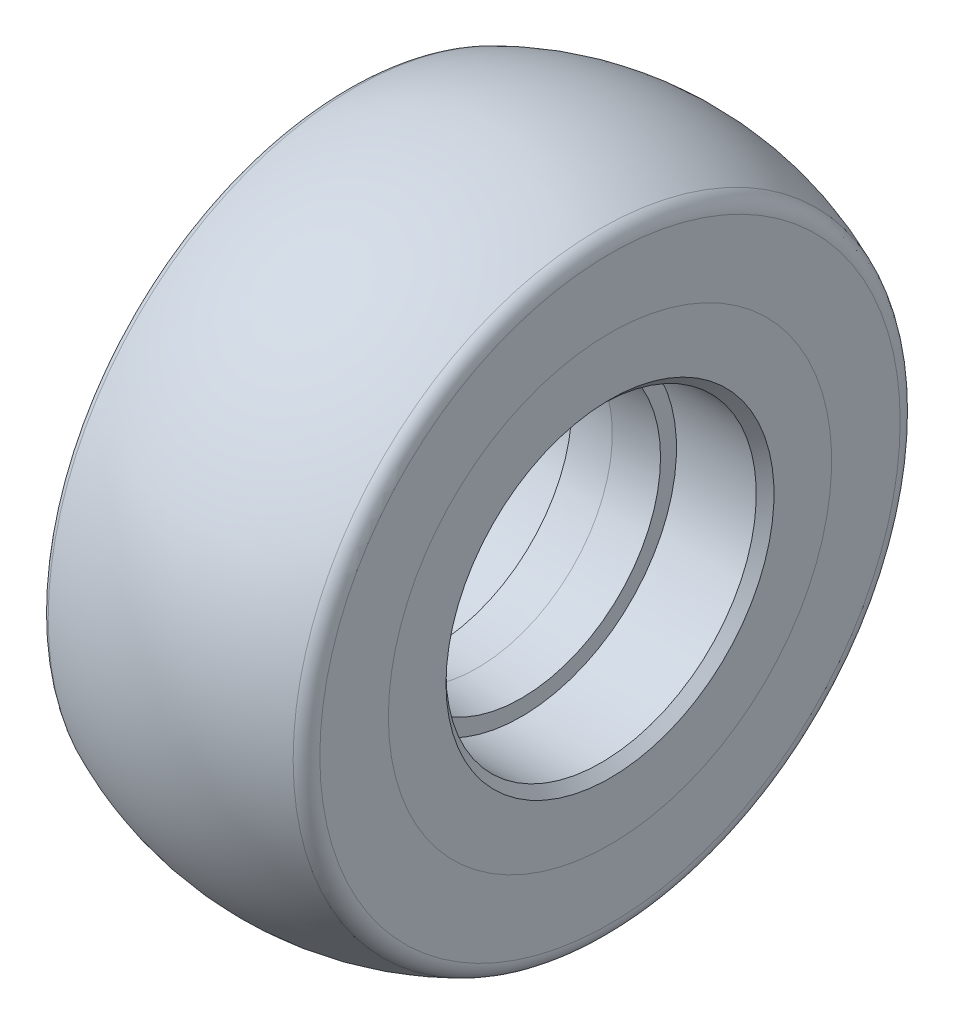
ISO-10303-21;
HEADER;
FILE_DESCRIPTION(('STEP AP214'),'2;1');
FILE_NAME('part.step','',(''),(''),'','','');
FILE_SCHEMA(('AUTOMOTIVE_DESIGN { 1 0 10303 214 1 1 1 1 }'));
ENDSEC;
DATA;
#1=APPLICATION_CONTEXT('core data for automotive mechanical design processes');
#2=APPLICATION_PROTOCOL_DEFINITION('international standard','automotive_design',2000,#1);
#3=PRODUCT_CONTEXT('',#1,'mechanical');
#4=PRODUCT('Part','Part','',(#3));
#5=PRODUCT_RELATED_PRODUCT_CATEGORY('part','',(#4));
#6=PRODUCT_DEFINITION_FORMATION('','',#4);
#7=PRODUCT_DEFINITION_CONTEXT('part definition',#1,'design');
#8=PRODUCT_DEFINITION('design','',#6,#7);
#9=PRODUCT_DEFINITION_SHAPE('','',#8);
#10=(LENGTH_UNIT() NAMED_UNIT(*) SI_UNIT(.MILLI.,.METRE.));
#11=(NAMED_UNIT(*) PLANE_ANGLE_UNIT() SI_UNIT($,.RADIAN.));
#12=(NAMED_UNIT(*) SI_UNIT($,.STERADIAN.) SOLID_ANGLE_UNIT());
#13=UNCERTAINTY_MEASURE_WITH_UNIT(LENGTH_MEASURE(1.E-05),#10,'distance_accuracy_value','');
#14=(GEOMETRIC_REPRESENTATION_CONTEXT(3) GLOBAL_UNCERTAINTY_ASSIGNED_CONTEXT((#13)) GLOBAL_UNIT_ASSIGNED_CONTEXT((#10,
#11,#12)) REPRESENTATION_CONTEXT('',''));
#15=CARTESIAN_POINT('',(0.,0.,0.));
#16=DIRECTION('',(0.,0.,1.));
#17=DIRECTION('',(1.,0.,0.));
#18=AXIS2_PLACEMENT_3D('',#15,#16,#17);
#19=CARTESIAN_POINT('',(-15.,0.,-32.7309114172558));
#20=DIRECTION('',(1.,0.,0.));
#21=DIRECTION('',(0.,0.,-1.));
#22=AXIS2_PLACEMENT_3D('',#19,#20,#21);
#23=PLANE('',#22);
#24=CARTESIAN_POINT('',(-15.,0.,0.));
#25=DIRECTION('',(-1.,0.,0.));
#26=DIRECTION('',(0.,0.,1.));
#27=AXIS2_PLACEMENT_3D('',#24,#25,#26);
#28=CIRCLE('',#27,25.);
#29=CARTESIAN_POINT('',(-15.,0.,25.));
#30=VERTEX_POINT('',#29);
#31=EDGE_CURVE('E11',#30,#30,#28,.T.);
#32=ORIENTED_EDGE('',*,*,#31,.F.);
#33=EDGE_LOOP('',(#32));
#34=FACE_BOUND('',#33,.T.);
#35=CARTESIAN_POINT('',(-15.,0.,0.));
#36=DIRECTION('',(-1.,0.,0.));
#37=DIRECTION('',(0.,0.,1.));
#38=AXIS2_PLACEMENT_3D('',#35,#36,#37);
#39=CIRCLE('',#38,32.7309114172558);
#40=CARTESIAN_POINT('',(-15.,0.,32.7309114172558));
#41=VERTEX_POINT('',#40);
#42=EDGE_CURVE('E94',#41,#41,#39,.T.);
#43=ORIENTED_EDGE('',*,*,#42,.T.);
#44=EDGE_LOOP('',(#43));
#45=FACE_BOUND('',#44,.T.);
#46=ADVANCED_FACE('F45',(#34,#45),#23,.F.);
#47=CARTESIAN_POINT('',(-15.,0.,0.));
#48=DIRECTION('',(1.,0.,0.));
#49=DIRECTION('',(0.,0.,-1.));
#50=AXIS2_PLACEMENT_3D('',#47,#48,#49);
#51=CONICAL_SURFACE('',#50,25.,0.099668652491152);
#52=CARTESIAN_POINT('',(-10.5493370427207,0.,0.));
#53=DIRECTION('',(-1.,0.,0.));
#54=DIRECTION('',(0.,0.,1.));
#55=AXIS2_PLACEMENT_3D('',#52,#53,#54);
#56=CIRCLE('',#55,25.4450662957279);
#57=CARTESIAN_POINT('',(-10.5493370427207,0.,25.4450662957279));
#58=VERTEX_POINT('',#57);
#59=EDGE_CURVE('E51',#58,#58,#56,.T.);
#60=ORIENTED_EDGE('',*,*,#59,.F.);
#61=EDGE_LOOP('',(#60));
#62=FACE_BOUND('',#61,.T.);
#63=ORIENTED_EDGE('',*,*,#31,.T.);
#64=EDGE_LOOP('',(#63));
#65=FACE_BOUND('',#64,.T.);
#66=ADVANCED_FACE('F173',(#62,#65),#51,.F.);
#67=CARTESIAN_POINT('',(-10.8478481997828,0.,0.));
#68=DIRECTION('',(-1.,0.,0.));
#69=DIRECTION('',(0.,0.,1.));
#70=AXIS2_PLACEMENT_3D('',#67,#68,#69);
#71=TOROIDAL_SURFACE('',#70,28.4301778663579,3.);
#72=CARTESIAN_POINT('',(-9.50620741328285,0.,0.));
#73=DIRECTION('',(-1.,0.,0.));
#74=DIRECTION('',(0.,0.,1.));
#75=AXIS2_PLACEMENT_3D('',#72,#73,#74);
#76=CIRCLE('',#75,25.7468962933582);
#77=CARTESIAN_POINT('',(-9.50620741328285,0.,25.7468962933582));
#78=VERTEX_POINT('',#77);
#79=EDGE_CURVE('E55',#78,#78,#76,.T.);
#80=ORIENTED_EDGE('',*,*,#79,.F.);
#81=EDGE_LOOP('',(#80));
#82=FACE_BOUND('',#81,.T.);
#83=ORIENTED_EDGE('',*,*,#59,.T.);
#84=EDGE_LOOP('',(#83));
#85=FACE_BOUND('',#84,.T.);
#86=ADVANCED_FACE('F168',(#82,#85),#71,.T.);
#87=CARTESIAN_POINT('',(-9.50620741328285,0.,0.));
#88=DIRECTION('',(1.,0.,0.));
#89=DIRECTION('',(0.,0.,-1.));
#90=AXIS2_PLACEMENT_3D('',#87,#88,#89);
#91=CONICAL_SURFACE('',#90,25.7468962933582,0.463647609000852);
#92=CARTESIAN_POINT('',(-7.5348122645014,0.,0.));
#93=DIRECTION('',(-1.,0.,0.));
#94=DIRECTION('',(0.,0.,1.));
#95=AXIS2_PLACEMENT_3D('',#92,#93,#94);
#96=CIRCLE('',#95,26.7325938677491);
#97=CARTESIAN_POINT('',(-7.5348122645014,0.,26.7325938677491));
#98=VERTEX_POINT('',#97);
#99=EDGE_CURVE('E59',#98,#98,#96,.T.);
#100=ORIENTED_EDGE('',*,*,#99,.F.);
#101=EDGE_LOOP('',(#100));
#102=FACE_BOUND('',#101,.T.);
#103=ORIENTED_EDGE('',*,*,#79,.T.);
#104=EDGE_LOOP('',(#103));
#105=FACE_BOUND('',#104,.T.);
#106=ADVANCED_FACE('F162',(#102,#105),#91,.F.);
#107=CARTESIAN_POINT('',(-6.19317147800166,0.,0.));
#108=DIRECTION('',(-1.,0.,0.));
#109=DIRECTION('',(0.,0.,1.));
#110=AXIS2_PLACEMENT_3D('',#107,#108,#109);
#111=TOROIDAL_SURFACE('',#110,24.0493122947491,3.00000000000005);
#112=CARTESIAN_POINT('',(-6.40722627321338,0.,0.));
#113=DIRECTION('',(-1.,0.,0.));
#114=DIRECTION('',(0.,0.,1.));
#115=AXIS2_PLACEMENT_3D('',#112,#113,#114);
#116=CIRCLE('',#115,27.0416659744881);
#117=CARTESIAN_POINT('',(-6.40722627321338,0.,27.0416659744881));
#118=VERTEX_POINT('',#117);
#119=EDGE_CURVE('E64',#118,#118,#116,.T.);
#120=ORIENTED_EDGE('',*,*,#119,.F.);
#121=EDGE_LOOP('',(#120));
#122=FACE_BOUND('',#121,.T.);
#123=ORIENTED_EDGE('',*,*,#99,.T.);
#124=EDGE_LOOP('',(#123));
#125=FACE_BOUND('',#124,.T.);
#126=ADVANCED_FACE('F156',(#122,#125),#111,.F.);
#127=CARTESIAN_POINT('',(-6.40722627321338,0.,0.));
#128=DIRECTION('',(1.,0.,0.));
#129=DIRECTION('',(0.,0.,-1.));
#130=AXIS2_PLACEMENT_3D('',#127,#128,#129);
#131=CONICAL_SURFACE('',#130,27.0416659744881,0.0714122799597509);
#132=CARTESIAN_POINT('',(0.,0.,0.));
#133=DIRECTION('',(-1.,0.,0.));
#134=DIRECTION('',(0.,0.,1.));
#135=AXIS2_PLACEMENT_3D('',#132,#133,#134);
#136=CIRCLE('',#135,27.4999999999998);
#137=CARTESIAN_POINT('',(0.,0.,27.4999999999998));
#138=VERTEX_POINT('',#137);
#139=EDGE_CURVE('E67',#138,#138,#136,.T.);
#140=ORIENTED_EDGE('',*,*,#139,.F.);
#141=EDGE_LOOP('',(#140));
#142=FACE_BOUND('',#141,.T.);
#143=ORIENTED_EDGE('',*,*,#119,.T.);
#144=EDGE_LOOP('',(#143));
#145=FACE_BOUND('',#144,.T.);
#146=ADVANCED_FACE('F150',(#142,#145),#131,.F.);
#147=CARTESIAN_POINT('',(0.,0.,0.));
#148=DIRECTION('',(-1.,0.,0.));
#149=DIRECTION('',(0.,0.,1.));
#150=AXIS2_PLACEMENT_3D('',#147,#148,#149);
#151=CONICAL_SURFACE('',#150,27.4999999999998,0.071412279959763);
#152=CARTESIAN_POINT('',(6.40722627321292,0.,0.));
#153=DIRECTION('',(-1.,0.,0.));
#154=DIRECTION('',(0.,0.,1.));
#155=AXIS2_PLACEMENT_3D('',#152,#153,#154);
#156=CIRCLE('',#155,27.041665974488);
#157=CARTESIAN_POINT('',(6.40722627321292,0.,27.041665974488));
#158=VERTEX_POINT('',#157);
#159=EDGE_CURVE('E70',#158,#158,#156,.T.);
#160=ORIENTED_EDGE('',*,*,#159,.F.);
#161=EDGE_LOOP('',(#160));
#162=FACE_BOUND('',#161,.T.);
#163=ORIENTED_EDGE('',*,*,#139,.T.);
#164=EDGE_LOOP('',(#163));
#165=FACE_BOUND('',#164,.T.);
#166=ADVANCED_FACE('F144',(#162,#165),#151,.F.);
#167=CARTESIAN_POINT('',(6.1931714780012,0.,0.));
#168=DIRECTION('',(-1.,0.,0.));
#169=DIRECTION('',(0.,0.,1.));
#170=AXIS2_PLACEMENT_3D('',#167,#168,#169);
#171=TOROIDAL_SURFACE('',#170,24.0493122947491,3.);
#172=CARTESIAN_POINT('',(7.53481226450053,0.,0.));
#173=DIRECTION('',(-1.,0.,0.));
#174=DIRECTION('',(0.,0.,1.));
#175=AXIS2_PLACEMENT_3D('',#172,#173,#174);
#176=CIRCLE('',#175,26.7325938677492);
#177=CARTESIAN_POINT('',(7.53481226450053,0.,26.7325938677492));
#178=VERTEX_POINT('',#177);
#179=EDGE_CURVE('E73',#178,#178,#176,.T.);
#180=ORIENTED_EDGE('',*,*,#179,.F.);
#181=EDGE_LOOP('',(#180));
#182=FACE_BOUND('',#181,.T.);
#183=ORIENTED_EDGE('',*,*,#159,.T.);
#184=EDGE_LOOP('',(#183));
#185=FACE_BOUND('',#184,.T.);
#186=ADVANCED_FACE('F138',(#182,#185),#171,.F.);
#187=CARTESIAN_POINT('',(7.53481226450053,0.,0.));
#188=DIRECTION('',(-1.,0.,0.));
#189=DIRECTION('',(0.,0.,1.));
#190=AXIS2_PLACEMENT_3D('',#187,#188,#189);
#191=CONICAL_SURFACE('',#190,26.7325938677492,0.463647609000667);
#192=CARTESIAN_POINT('',(9.50620741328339,0.,0.));
#193=DIRECTION('',(-1.,0.,0.));
#194=DIRECTION('',(0.,0.,1.));
#195=AXIS2_PLACEMENT_3D('',#192,#193,#194);
#196=CIRCLE('',#195,25.7468962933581);
#197=CARTESIAN_POINT('',(9.50620741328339,0.,25.7468962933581));
#198=VERTEX_POINT('',#197);
#199=EDGE_CURVE('E76',#198,#198,#196,.T.);
#200=ORIENTED_EDGE('',*,*,#199,.F.);
#201=EDGE_LOOP('',(#200));
#202=FACE_BOUND('',#201,.T.);
#203=ORIENTED_EDGE('',*,*,#179,.T.);
#204=EDGE_LOOP('',(#203));
#205=FACE_BOUND('',#204,.T.);
#206=ADVANCED_FACE('F132',(#202,#205),#191,.F.);
#207=CARTESIAN_POINT('',(10.8478481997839,0.,0.));
#208=DIRECTION('',(-1.,0.,0.));
#209=DIRECTION('',(0.,0.,1.));
#210=AXIS2_PLACEMENT_3D('',#207,#208,#209);
#211=TOROIDAL_SURFACE('',#210,28.4301778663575,2.99999999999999);
#212=CARTESIAN_POINT('',(10.5493370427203,0.,0.));
#213=DIRECTION('',(-1.,0.,0.));
#214=DIRECTION('',(0.,0.,1.));
#215=AXIS2_PLACEMENT_3D('',#212,#213,#214);
#216=CIRCLE('',#215,25.4450662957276);
#217=CARTESIAN_POINT('',(10.5493370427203,0.,25.4450662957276));
#218=VERTEX_POINT('',#217);
#219=EDGE_CURVE('E79',#218,#218,#216,.T.);
#220=ORIENTED_EDGE('',*,*,#219,.F.);
#221=EDGE_LOOP('',(#220));
#222=FACE_BOUND('',#221,.T.);
#223=ORIENTED_EDGE('',*,*,#199,.T.);
#224=EDGE_LOOP('',(#223));
#225=FACE_BOUND('',#224,.T.);
#226=ADVANCED_FACE('F126',(#222,#225),#211,.T.);
#227=CARTESIAN_POINT('',(10.5493370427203,0.,0.));
#228=DIRECTION('',(-1.,0.,0.));
#229=DIRECTION('',(0.,0.,1.));
#230=AXIS2_PLACEMENT_3D('',#227,#228,#229);
#231=CONICAL_SURFACE('',#230,25.4450662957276,0.0996686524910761);
#232=CARTESIAN_POINT('',(15.,0.,0.));
#233=DIRECTION('',(-1.,0.,0.));
#234=DIRECTION('',(0.,0.,1.));
#235=AXIS2_PLACEMENT_3D('',#232,#233,#234);
#236=CIRCLE('',#235,25.);
#237=CARTESIAN_POINT('',(15.,0.,25.));
#238=VERTEX_POINT('',#237);
#239=EDGE_CURVE('E82',#238,#238,#236,.T.);
#240=ORIENTED_EDGE('',*,*,#239,.F.);
#241=EDGE_LOOP('',(#240));
#242=FACE_BOUND('',#241,.T.);
#243=ORIENTED_EDGE('',*,*,#219,.T.);
#244=EDGE_LOOP('',(#243));
#245=FACE_BOUND('',#244,.T.);
#246=ADVANCED_FACE('F120',(#242,#245),#231,.F.);
#247=CARTESIAN_POINT('',(15.,0.,-25.));
#248=DIRECTION('',(-1.,0.,0.));
#249=DIRECTION('',(0.,0.,1.));
#250=AXIS2_PLACEMENT_3D('',#247,#248,#249);
#251=PLANE('',#250);
#252=CARTESIAN_POINT('',(15.,0.,0.));
#253=DIRECTION('',(-1.,0.,0.));
#254=DIRECTION('',(0.,0.,1.));
#255=AXIS2_PLACEMENT_3D('',#252,#253,#254);
#256=CIRCLE('',#255,32.7309114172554);
#257=CARTESIAN_POINT('',(15.,0.,32.7309114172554));
#258=VERTEX_POINT('',#257);
#259=EDGE_CURVE('E85',#258,#258,#256,.T.);
#260=ORIENTED_EDGE('',*,*,#259,.F.);
#261=EDGE_LOOP('',(#260));
#262=FACE_BOUND('',#261,.T.);
#263=ORIENTED_EDGE('',*,*,#239,.T.);
#264=EDGE_LOOP('',(#263));
#265=FACE_BOUND('',#264,.T.);
#266=ADVANCED_FACE('F114',(#262,#265),#251,.F.);
#267=CARTESIAN_POINT('',(13.,0.,0.));
#268=DIRECTION('',(-1.,0.,0.));
#269=DIRECTION('',(0.,0.,1.));
#270=AXIS2_PLACEMENT_3D('',#267,#268,#269);
#271=TOROIDAL_SURFACE('',#270,32.7309114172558,2.);
#272=CARTESIAN_POINT('',(13.8150470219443,0.,0.));
#273=DIRECTION('',(-1.,0.,0.));
#274=DIRECTION('',(0.,0.,1.));
#275=AXIS2_PLACEMENT_3D('',#272,#273,#274);
#276=CIRCLE('',#275,34.5573008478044);
#277=CARTESIAN_POINT('',(13.8150470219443,0.,34.5573008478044));
#278=VERTEX_POINT('',#277);
#279=EDGE_CURVE('E88',#278,#278,#276,.T.);
#280=ORIENTED_EDGE('',*,*,#279,.F.);
#281=EDGE_LOOP('',(#280));
#282=FACE_BOUND('',#281,.T.);
#283=ORIENTED_EDGE('',*,*,#259,.T.);
#284=EDGE_LOOP('',(#283));
#285=FACE_BOUND('',#284,.T.);
#286=ADVANCED_FACE('F108',(#282,#285),#271,.T.);
#287=CARTESIAN_POINT('',(2.34989252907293E-13,0.,0.));
#288=DIRECTION('',(-1.,0.,0.));
#289=DIRECTION('',(0.,0.,1.));
#290=AXIS2_PLACEMENT_3D('',#287,#288,#289);
#291=DEGENERATE_TOROIDAL_SURFACE('',#290,3.60000000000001,33.9,.T.);
#292=CARTESIAN_POINT('',(-13.8150470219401,0.,0.));
#293=DIRECTION('',(-1.,0.,0.));
#294=DIRECTION('',(0.,0.,1.));
#295=AXIS2_PLACEMENT_3D('',#292,#293,#294);
#296=CIRCLE('',#295,34.5573008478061);
#297=CARTESIAN_POINT('',(-13.8150470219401,0.,34.5573008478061));
#298=VERTEX_POINT('',#297);
#299=EDGE_CURVE('E91',#298,#298,#296,.T.);
#300=ORIENTED_EDGE('',*,*,#299,.F.);
#301=EDGE_LOOP('',(#300));
#302=FACE_BOUND('',#301,.T.);
#303=ORIENTED_EDGE('',*,*,#279,.T.);
#304=EDGE_LOOP('',(#303));
#305=FACE_BOUND('',#304,.T.);
#306=ADVANCED_FACE('F102',(#302,#305),#291,.T.);
#307=CARTESIAN_POINT('',(-13.,0.,0.));
#308=DIRECTION('',(-1.,0.,0.));
#309=DIRECTION('',(0.,0.,1.));
#310=AXIS2_PLACEMENT_3D('',#307,#308,#309);
#311=TOROIDAL_SURFACE('',#310,32.7309114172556,2.);
#312=ORIENTED_EDGE('',*,*,#42,.F.);
#313=EDGE_LOOP('',(#312));
#314=FACE_BOUND('',#313,.T.);
#315=ORIENTED_EDGE('',*,*,#299,.T.);
#316=EDGE_LOOP('',(#315));
#317=FACE_BOUND('',#316,.T.);
#318=ADVANCED_FACE('F99',(#314,#317),#311,.T.);
#319=CLOSED_SHELL('',(#46,#66,#86,#106,#126,#146,#166,#186,#206,#226,#246,#266,#286,#306,#318));
#320=MANIFOLD_SOLID_BREP('B2',#319);
#321=CARTESIAN_POINT('',(14.,0.,0.));
#322=DIRECTION('',(1.,0.,0.));
#323=DIRECTION('',(0.,0.,-1.));
#324=AXIS2_PLACEMENT_3D('',#321,#322,#323);
#325=CONICAL_SURFACE('',#324,17.5,0.78539816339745);
#326=CARTESIAN_POINT('',(15.,0.,0.));
#327=DIRECTION('',(-1.,0.,0.));
#328=DIRECTION('',(0.,0.,1.));
#329=AXIS2_PLACEMENT_3D('',#326,#327,#328);
#330=CIRCLE('',#329,18.5);
#331=CARTESIAN_POINT('',(15.,0.,18.5));
#332=VERTEX_POINT('',#331);
#333=EDGE_CURVE('E44',#332,#332,#330,.T.);
#334=ORIENTED_EDGE('',*,*,#333,.F.);
#335=EDGE_LOOP('',(#334));
#336=FACE_BOUND('',#335,.T.);
#337=CARTESIAN_POINT('',(14.,0.,0.));
#338=DIRECTION('',(-1.,0.,0.));
#339=DIRECTION('',(0.,0.,1.));
#340=AXIS2_PLACEMENT_3D('',#337,#338,#339);
#341=CIRCLE('',#340,17.5);
#342=CARTESIAN_POINT('',(14.,0.,17.5));
#343=VERTEX_POINT('',#342);
#344=EDGE_CURVE('E336',#343,#343,#341,.T.);
#345=ORIENTED_EDGE('',*,*,#344,.T.);
#346=EDGE_LOOP('',(#345));
#347=FACE_BOUND('',#346,.T.);
#348=ADVANCED_FACE('F272',(#336,#347),#325,.F.);
#349=CARTESIAN_POINT('',(15.,0.,-18.5));
#350=DIRECTION('',(-1.,0.,0.));
#351=DIRECTION('',(0.,0.,1.));
#352=AXIS2_PLACEMENT_3D('',#349,#350,#351);
#353=PLANE('',#352);
#354=CARTESIAN_POINT('',(15.,0.,0.));
#355=DIRECTION('',(-1.,0.,0.));
#356=DIRECTION('',(0.,0.,1.));
#357=AXIS2_PLACEMENT_3D('',#354,#355,#356);
#358=CIRCLE('',#357,25.);
#359=CARTESIAN_POINT('',(15.,0.,25.));
#360=VERTEX_POINT('',#359);
#361=EDGE_CURVE('E278',#360,#360,#358,.T.);
#362=ORIENTED_EDGE('',*,*,#361,.F.);
#363=EDGE_LOOP('',(#362));
#364=FACE_BOUND('',#363,.T.);
#365=ORIENTED_EDGE('',*,*,#333,.T.);
#366=EDGE_LOOP('',(#365));
#367=FACE_BOUND('',#366,.T.);
#368=ADVANCED_FACE('F445',(#364,#367),#353,.F.);
#369=CARTESIAN_POINT('',(15.,0.,0.));
#370=DIRECTION('',(-1.,0.,0.));
#371=DIRECTION('',(0.,0.,1.));
#372=AXIS2_PLACEMENT_3D('',#369,#370,#371);
#373=CONICAL_SURFACE('',#372,25.,0.0996686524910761);
#374=CARTESIAN_POINT('',(10.5493370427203,0.,0.));
#375=DIRECTION('',(-1.,0.,0.));
#376=DIRECTION('',(0.,0.,1.));
#377=AXIS2_PLACEMENT_3D('',#374,#375,#376);
#378=CIRCLE('',#377,25.4450662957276);
#379=CARTESIAN_POINT('',(10.5493370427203,0.,25.4450662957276));
#380=VERTEX_POINT('',#379);
#381=EDGE_CURVE('E282',#380,#380,#378,.T.);
#382=ORIENTED_EDGE('',*,*,#381,.F.);
#383=EDGE_LOOP('',(#382));
#384=FACE_BOUND('',#383,.T.);
#385=ORIENTED_EDGE('',*,*,#361,.T.);
#386=EDGE_LOOP('',(#385));
#387=FACE_BOUND('',#386,.T.);
#388=ADVANCED_FACE('F440',(#384,#387),#373,.T.);
#389=CARTESIAN_POINT('',(10.8478481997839,0.,0.));
#390=DIRECTION('',(-1.,0.,0.));
#391=DIRECTION('',(0.,0.,1.));
#392=AXIS2_PLACEMENT_3D('',#389,#390,#391);
#393=TOROIDAL_SURFACE('',#392,28.4301778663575,2.99999999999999);
#394=CARTESIAN_POINT('',(9.50620741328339,0.,0.));
#395=DIRECTION('',(-1.,0.,0.));
#396=DIRECTION('',(0.,0.,1.));
#397=AXIS2_PLACEMENT_3D('',#394,#395,#396);
#398=CIRCLE('',#397,25.7468962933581);
#399=CARTESIAN_POINT('',(9.50620741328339,0.,25.7468962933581));
#400=VERTEX_POINT('',#399);
#401=EDGE_CURVE('E286',#400,#400,#398,.T.);
#402=ORIENTED_EDGE('',*,*,#401,.F.);
#403=EDGE_LOOP('',(#402));
#404=FACE_BOUND('',#403,.T.);
#405=ORIENTED_EDGE('',*,*,#381,.T.);
#406=EDGE_LOOP('',(#405));
#407=FACE_BOUND('',#406,.T.);
#408=ADVANCED_FACE('F434',(#404,#407),#393,.F.);
#409=CARTESIAN_POINT('',(9.50620741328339,0.,0.));
#410=DIRECTION('',(-1.,0.,0.));
#411=DIRECTION('',(0.,0.,1.));
#412=AXIS2_PLACEMENT_3D('',#409,#410,#411);
#413=CONICAL_SURFACE('',#412,25.7468962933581,0.463647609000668);
#414=CARTESIAN_POINT('',(7.53481226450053,0.,0.));
#415=DIRECTION('',(-1.,0.,0.));
#416=DIRECTION('',(0.,0.,1.));
#417=AXIS2_PLACEMENT_3D('',#414,#415,#416);
#418=CIRCLE('',#417,26.7325938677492);
#419=CARTESIAN_POINT('',(7.53481226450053,0.,26.7325938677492));
#420=VERTEX_POINT('',#419);
#421=EDGE_CURVE('E291',#420,#420,#418,.T.);
#422=ORIENTED_EDGE('',*,*,#421,.F.);
#423=EDGE_LOOP('',(#422));
#424=FACE_BOUND('',#423,.T.);
#425=ORIENTED_EDGE('',*,*,#401,.T.);
#426=EDGE_LOOP('',(#425));
#427=FACE_BOUND('',#426,.T.);
#428=ADVANCED_FACE('F428',(#424,#427),#413,.T.);
#429=CARTESIAN_POINT('',(6.1931714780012,0.,0.));
#430=DIRECTION('',(-1.,0.,0.));
#431=DIRECTION('',(0.,0.,1.));
#432=AXIS2_PLACEMENT_3D('',#429,#430,#431);
#433=TOROIDAL_SURFACE('',#432,24.0493122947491,3.);
#434=CARTESIAN_POINT('',(6.40722627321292,0.,0.));
#435=DIRECTION('',(-1.,0.,0.));
#436=DIRECTION('',(0.,0.,1.));
#437=AXIS2_PLACEMENT_3D('',#434,#435,#436);
#438=CIRCLE('',#437,27.041665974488);
#439=CARTESIAN_POINT('',(6.40722627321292,0.,27.041665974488));
#440=VERTEX_POINT('',#439);
#441=EDGE_CURVE('E294',#440,#440,#438,.T.);
#442=ORIENTED_EDGE('',*,*,#441,.F.);
#443=EDGE_LOOP('',(#442));
#444=FACE_BOUND('',#443,.T.);
#445=ORIENTED_EDGE('',*,*,#421,.T.);
#446=EDGE_LOOP('',(#445));
#447=FACE_BOUND('',#446,.T.);
#448=ADVANCED_FACE('F422',(#444,#447),#433,.T.);
#449=CARTESIAN_POINT('',(6.40722627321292,0.,0.));
#450=DIRECTION('',(-1.,0.,0.));
#451=DIRECTION('',(0.,0.,1.));
#452=AXIS2_PLACEMENT_3D('',#449,#450,#451);
#453=CONICAL_SURFACE('',#452,27.041665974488,0.071412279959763);
#454=CARTESIAN_POINT('',(0.,0.,0.));
#455=DIRECTION('',(-1.,0.,0.));
#456=DIRECTION('',(0.,0.,1.));
#457=AXIS2_PLACEMENT_3D('',#454,#455,#456);
#458=CIRCLE('',#457,27.4999999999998);
#459=CARTESIAN_POINT('',(0.,0.,27.4999999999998));
#460=VERTEX_POINT('',#459);
#461=EDGE_CURVE('E297',#460,#460,#458,.T.);
#462=ORIENTED_EDGE('',*,*,#461,.F.);
#463=EDGE_LOOP('',(#462));
#464=FACE_BOUND('',#463,.T.);
#465=ORIENTED_EDGE('',*,*,#441,.T.);
#466=EDGE_LOOP('',(#465));
#467=FACE_BOUND('',#466,.T.);
#468=ADVANCED_FACE('F416',(#464,#467),#453,.T.);
#469=CARTESIAN_POINT('',(0.,0.,0.));
#470=DIRECTION('',(1.,0.,0.));
#471=DIRECTION('',(0.,0.,-1.));
#472=AXIS2_PLACEMENT_3D('',#469,#470,#471);
#473=CONICAL_SURFACE('',#472,27.4999999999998,0.0714122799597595);
#474=CARTESIAN_POINT('',(-6.40722627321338,0.,0.));
#475=DIRECTION('',(-1.,0.,0.));
#476=DIRECTION('',(0.,0.,1.));
#477=AXIS2_PLACEMENT_3D('',#474,#475,#476);
#478=CIRCLE('',#477,27.041665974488);
#479=CARTESIAN_POINT('',(-6.40722627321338,0.,27.041665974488));
#480=VERTEX_POINT('',#479);
#481=EDGE_CURVE('E300',#480,#480,#478,.T.);
#482=ORIENTED_EDGE('',*,*,#481,.F.);
#483=EDGE_LOOP('',(#482));
#484=FACE_BOUND('',#483,.T.);
#485=ORIENTED_EDGE('',*,*,#461,.T.);
#486=EDGE_LOOP('',(#485));
#487=FACE_BOUND('',#486,.T.);
#488=ADVANCED_FACE('F410',(#484,#487),#473,.T.);
#489=CARTESIAN_POINT('',(-6.19317147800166,0.,0.));
#490=DIRECTION('',(-1.,0.,0.));
#491=DIRECTION('',(0.,0.,1.));
#492=AXIS2_PLACEMENT_3D('',#489,#490,#491);
#493=TOROIDAL_SURFACE('',#492,24.0493122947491,3.00000000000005);
#494=CARTESIAN_POINT('',(-7.53481226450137,0.,0.));
#495=DIRECTION('',(-1.,0.,0.));
#496=DIRECTION('',(0.,0.,1.));
#497=AXIS2_PLACEMENT_3D('',#494,#495,#496);
#498=CIRCLE('',#497,26.732593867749);
#499=CARTESIAN_POINT('',(-7.53481226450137,0.,26.732593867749));
#500=VERTEX_POINT('',#499);
#501=EDGE_CURVE('E303',#500,#500,#498,.T.);
#502=ORIENTED_EDGE('',*,*,#501,.F.);
#503=EDGE_LOOP('',(#502));
#504=FACE_BOUND('',#503,.T.);
#505=ORIENTED_EDGE('',*,*,#481,.T.);
#506=EDGE_LOOP('',(#505));
#507=FACE_BOUND('',#506,.T.);
#508=ADVANCED_FACE('F404',(#504,#507),#493,.T.);
#509=CARTESIAN_POINT('',(-7.53481226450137,0.,0.));
#510=DIRECTION('',(1.,0.,0.));
#511=DIRECTION('',(0.,0.,-1.));
#512=AXIS2_PLACEMENT_3D('',#509,#510,#511);
#513=CONICAL_SURFACE('',#512,26.732593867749,0.463647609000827);
#514=CARTESIAN_POINT('',(-9.50620741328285,0.,0.));
#515=DIRECTION('',(-1.,0.,0.));
#516=DIRECTION('',(0.,0.,1.));
#517=AXIS2_PLACEMENT_3D('',#514,#515,#516);
#518=CIRCLE('',#517,25.7468962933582);
#519=CARTESIAN_POINT('',(-9.50620741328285,0.,25.7468962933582));
#520=VERTEX_POINT('',#519);
#521=EDGE_CURVE('E306',#520,#520,#518,.T.);
#522=ORIENTED_EDGE('',*,*,#521,.F.);
#523=EDGE_LOOP('',(#522));
#524=FACE_BOUND('',#523,.T.);
#525=ORIENTED_EDGE('',*,*,#501,.T.);
#526=EDGE_LOOP('',(#525));
#527=FACE_BOUND('',#526,.T.);
#528=ADVANCED_FACE('F398',(#524,#527),#513,.T.);
#529=CARTESIAN_POINT('',(-10.8478481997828,0.,0.));
#530=DIRECTION('',(-1.,0.,0.));
#531=DIRECTION('',(0.,0.,1.));
#532=AXIS2_PLACEMENT_3D('',#529,#530,#531);
#533=TOROIDAL_SURFACE('',#532,28.4301778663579,3.);
#534=CARTESIAN_POINT('',(-10.5493370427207,0.,0.));
#535=DIRECTION('',(-1.,0.,0.));
#536=DIRECTION('',(0.,0.,1.));
#537=AXIS2_PLACEMENT_3D('',#534,#535,#536);
#538=CIRCLE('',#537,25.4450662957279);
#539=CARTESIAN_POINT('',(-10.5493370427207,0.,25.4450662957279));
#540=VERTEX_POINT('',#539);
#541=EDGE_CURVE('E309',#540,#540,#538,.T.);
#542=ORIENTED_EDGE('',*,*,#541,.F.);
#543=EDGE_LOOP('',(#542));
#544=FACE_BOUND('',#543,.T.);
#545=ORIENTED_EDGE('',*,*,#521,.T.);
#546=EDGE_LOOP('',(#545));
#547=FACE_BOUND('',#546,.T.);
#548=ADVANCED_FACE('F392',(#544,#547),#533,.F.);
#549=CARTESIAN_POINT('',(-10.5493370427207,0.,0.));
#550=DIRECTION('',(1.,0.,0.));
#551=DIRECTION('',(0.,0.,-1.));
#552=AXIS2_PLACEMENT_3D('',#549,#550,#551);
#553=CONICAL_SURFACE('',#552,25.4450662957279,0.099668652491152);
#554=CARTESIAN_POINT('',(-15.,0.,0.));
#555=DIRECTION('',(-1.,0.,0.));
#556=DIRECTION('',(0.,0.,1.));
#557=AXIS2_PLACEMENT_3D('',#554,#555,#556);
#558=CIRCLE('',#557,25.);
#559=CARTESIAN_POINT('',(-15.,0.,25.));
#560=VERTEX_POINT('',#559);
#561=EDGE_CURVE('E312',#560,#560,#558,.T.);
#562=ORIENTED_EDGE('',*,*,#561,.F.);
#563=EDGE_LOOP('',(#562));
#564=FACE_BOUND('',#563,.T.);
#565=ORIENTED_EDGE('',*,*,#541,.T.);
#566=EDGE_LOOP('',(#565));
#567=FACE_BOUND('',#566,.T.);
#568=ADVANCED_FACE('F386',(#564,#567),#553,.T.);
#569=CARTESIAN_POINT('',(-15.,0.,-25.));
#570=DIRECTION('',(1.,0.,0.));
#571=DIRECTION('',(0.,0.,-1.));
#572=AXIS2_PLACEMENT_3D('',#569,#570,#571);
#573=PLANE('',#572);
#574=CARTESIAN_POINT('',(-15.,0.,0.));
#575=DIRECTION('',(-1.,0.,0.));
#576=DIRECTION('',(0.,0.,1.));
#577=AXIS2_PLACEMENT_3D('',#574,#575,#576);
#578=CIRCLE('',#577,18.5);
#579=CARTESIAN_POINT('',(-15.,0.,18.5));
#580=VERTEX_POINT('',#579);
#581=EDGE_CURVE('E315',#580,#580,#578,.T.);
#582=ORIENTED_EDGE('',*,*,#581,.F.);
#583=EDGE_LOOP('',(#582));
#584=FACE_BOUND('',#583,.T.);
#585=ORIENTED_EDGE('',*,*,#561,.T.);
#586=EDGE_LOOP('',(#585));
#587=FACE_BOUND('',#586,.T.);
#588=ADVANCED_FACE('F380',(#584,#587),#573,.F.);
#589=CARTESIAN_POINT('',(-15.,0.,0.));
#590=DIRECTION('',(-1.,0.,0.));
#591=DIRECTION('',(0.,0.,1.));
#592=AXIS2_PLACEMENT_3D('',#589,#590,#591);
#593=CONICAL_SURFACE('',#592,18.5,0.785398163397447);
#594=CARTESIAN_POINT('',(-14.,0.,0.));
#595=DIRECTION('',(-1.,0.,0.));
#596=DIRECTION('',(0.,0.,1.));
#597=AXIS2_PLACEMENT_3D('',#594,#595,#596);
#598=CIRCLE('',#597,17.5);
#599=CARTESIAN_POINT('',(-14.,0.,17.5));
#600=VERTEX_POINT('',#599);
#601=EDGE_CURVE('E318',#600,#600,#598,.T.);
#602=ORIENTED_EDGE('',*,*,#601,.F.);
#603=EDGE_LOOP('',(#602));
#604=FACE_BOUND('',#603,.T.);
#605=ORIENTED_EDGE('',*,*,#581,.T.);
#606=EDGE_LOOP('',(#605));
#607=FACE_BOUND('',#606,.T.);
#608=ADVANCED_FACE('F374',(#604,#607),#593,.F.);
#609=CARTESIAN_POINT('',(-18.9390646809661,0.,0.));
#610=DIRECTION('',(-1.,0.,0.));
#611=DIRECTION('',(0.,0.,1.));
#612=AXIS2_PLACEMENT_3D('',#609,#610,#611);
#613=CYLINDRICAL_SURFACE('',#612,17.5);
#614=CARTESIAN_POINT('',(-5.,0.,0.));
#615=DIRECTION('',(-1.,0.,0.));
#616=DIRECTION('',(0.,0.,1.));
#617=AXIS2_PLACEMENT_3D('',#614,#615,#616);
#618=CIRCLE('',#617,17.5);
#619=CARTESIAN_POINT('',(-5.,0.,17.5));
#620=VERTEX_POINT('',#619);
#621=EDGE_CURVE('E321',#620,#620,#618,.T.);
#622=ORIENTED_EDGE('',*,*,#621,.F.);
#623=EDGE_LOOP('',(#622));
#624=FACE_BOUND('',#623,.T.);
#625=ORIENTED_EDGE('',*,*,#601,.T.);
#626=EDGE_LOOP('',(#625));
#627=FACE_BOUND('',#626,.T.);
#628=ADVANCED_FACE('F368',(#624,#627),#613,.F.);
#629=CARTESIAN_POINT('',(-5.,0.,-17.5));
#630=DIRECTION('',(1.,0.,0.));
#631=DIRECTION('',(0.,0.,-1.));
#632=AXIS2_PLACEMENT_3D('',#629,#630,#631);
#633=PLANE('',#632);
#634=CARTESIAN_POINT('',(-5.,0.,0.));
#635=DIRECTION('',(-1.,0.,0.));
#636=DIRECTION('',(0.,0.,1.));
#637=AXIS2_PLACEMENT_3D('',#634,#635,#636);
#638=CIRCLE('',#637,15.7);
#639=CARTESIAN_POINT('',(-5.,0.,15.7));
#640=VERTEX_POINT('',#639);
#641=EDGE_CURVE('E324',#640,#640,#638,.T.);
#642=ORIENTED_EDGE('',*,*,#641,.F.);
#643=EDGE_LOOP('',(#642));
#644=FACE_BOUND('',#643,.T.);
#645=ORIENTED_EDGE('',*,*,#621,.T.);
#646=EDGE_LOOP('',(#645));
#647=FACE_BOUND('',#646,.T.);
#648=ADVANCED_FACE('F362',(#644,#647),#633,.F.);
#649=CARTESIAN_POINT('',(-5.,0.,0.));
#650=DIRECTION('',(-1.,0.,0.));
#651=DIRECTION('',(0.,0.,1.));
#652=AXIS2_PLACEMENT_3D('',#649,#650,#651);
#653=CONICAL_SURFACE('',#652,15.7,0.0872664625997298);
#654=CARTESIAN_POINT('',(0.,0.,0.));
#655=DIRECTION('',(-1.,0.,0.));
#656=DIRECTION('',(0.,0.,1.));
#657=AXIS2_PLACEMENT_3D('',#654,#655,#656);
#658=CIRCLE('',#657,15.2625566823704);
#659=CARTESIAN_POINT('',(0.,0.,15.2625566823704));
#660=VERTEX_POINT('',#659);
#661=EDGE_CURVE('E327',#660,#660,#658,.T.);
#662=ORIENTED_EDGE('',*,*,#661,.F.);
#663=EDGE_LOOP('',(#662));
#664=FACE_BOUND('',#663,.T.);
#665=ORIENTED_EDGE('',*,*,#641,.T.);
#666=EDGE_LOOP('',(#665));
#667=FACE_BOUND('',#666,.T.);
#668=ADVANCED_FACE('F356',(#664,#667),#653,.F.);
#669=CARTESIAN_POINT('',(0.,0.,0.));
#670=DIRECTION('',(1.,0.,0.));
#671=DIRECTION('',(0.,0.,-1.));
#672=AXIS2_PLACEMENT_3D('',#669,#670,#671);
#673=CONICAL_SURFACE('',#672,15.2625566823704,0.0872664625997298);
#674=CARTESIAN_POINT('',(5.,0.,0.));
#675=DIRECTION('',(-1.,0.,0.));
#676=DIRECTION('',(0.,0.,1.));
#677=AXIS2_PLACEMENT_3D('',#674,#675,#676);
#678=CIRCLE('',#677,15.7);
#679=CARTESIAN_POINT('',(5.,0.,15.7));
#680=VERTEX_POINT('',#679);
#681=EDGE_CURVE('E330',#680,#680,#678,.T.);
#682=ORIENTED_EDGE('',*,*,#681,.F.);
#683=EDGE_LOOP('',(#682));
#684=FACE_BOUND('',#683,.T.);
#685=ORIENTED_EDGE('',*,*,#661,.T.);
#686=EDGE_LOOP('',(#685));
#687=FACE_BOUND('',#686,.T.);
#688=ADVANCED_FACE('F350',(#684,#687),#673,.F.);
#689=CARTESIAN_POINT('',(5.,0.,-15.7));
#690=DIRECTION('',(-1.,0.,0.));
#691=DIRECTION('',(0.,0.,1.));
#692=AXIS2_PLACEMENT_3D('',#689,#690,#691);
#693=PLANE('',#692);
#694=CARTESIAN_POINT('',(5.,0.,0.));
#695=DIRECTION('',(-1.,0.,0.));
#696=DIRECTION('',(0.,0.,1.));
#697=AXIS2_PLACEMENT_3D('',#694,#695,#696);
#698=CIRCLE('',#697,17.5);
#699=CARTESIAN_POINT('',(5.,0.,17.5));
#700=VERTEX_POINT('',#699);
#701=EDGE_CURVE('E333',#700,#700,#698,.T.);
#702=ORIENTED_EDGE('',*,*,#701,.F.);
#703=EDGE_LOOP('',(#702));
#704=FACE_BOUND('',#703,.T.);
#705=ORIENTED_EDGE('',*,*,#681,.T.);
#706=EDGE_LOOP('',(#705));
#707=FACE_BOUND('',#706,.T.);
#708=ADVANCED_FACE('F344',(#704,#707),#693,.F.);
#709=CARTESIAN_POINT('',(-18.9390646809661,0.,0.));
#710=DIRECTION('',(-1.,0.,0.));
#711=DIRECTION('',(0.,0.,1.));
#712=AXIS2_PLACEMENT_3D('',#709,#710,#711);
#713=CYLINDRICAL_SURFACE('',#712,17.5);
#714=ORIENTED_EDGE('',*,*,#344,.F.);
#715=EDGE_LOOP('',(#714));
#716=FACE_BOUND('',#715,.T.);
#717=ORIENTED_EDGE('',*,*,#701,.T.);
#718=EDGE_LOOP('',(#717));
#719=FACE_BOUND('',#718,.T.);
#720=ADVANCED_FACE('F341',(#716,#719),#713,.F.);
#721=CLOSED_SHELL('',(#348,#368,#388,#408,#428,#448,#468,#488,#508,#528,#548,#568,#588,#608,
#628,#648,#668,#688,#708,#720));
#722=MANIFOLD_SOLID_BREP('B6',#721);
#723=ADVANCED_BREP_SHAPE_REPRESENTATION('',(#18,#320,#722),#14);
#724=SHAPE_DEFINITION_REPRESENTATION(#9,#723);
ENDSEC;
END-ISO-10303-21;
